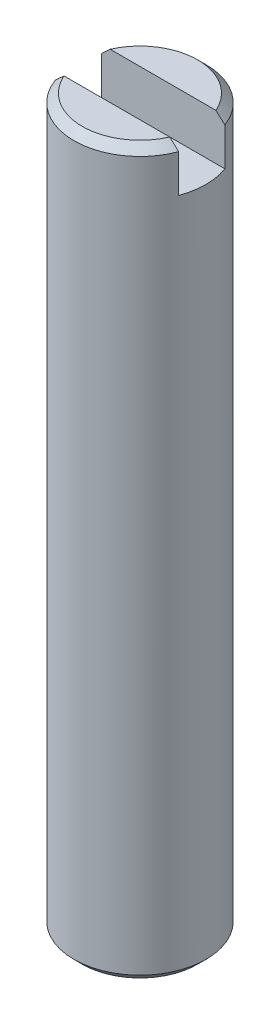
from build123d import *

# Parameters (mm, degrees)
ESQUISSE1_R             = 2
BASE_EXTRUSION_DEPTH    = 22
CHANFREIN1_SIZE         = 0.25
ENL_V_MAT_EXTRU_1_DEPTH = 1.4


with BuildPart() as part:
    # Esquisse1 → Base-Extrusion (new body)
    with BuildSketch(Plane(origin=(0, 0, 0), x_dir=(1, 0, 0), z_dir=(0, 1, 0))):
        with Locations(Location((0, 0, 0), (0, 0, 270))):
            Circle(ESQUISSE1_R)
    extrude(amount=-BASE_EXTRUSION_DEPTH)

    # Chanfrein1
    chanfrein1_edges = [part.edges().sort_by_distance(p)[0] for p in [
        (0, 0, -2),
        (0, -22, -2),
    ]]
    chamfer(chanfrein1_edges, length=CHANFREIN1_SIZE)

    # Esquisse2 → Enl_v. mat.-Extru.1 (cut)
    with BuildSketch(Plane(origin=(0, 0, 0), x_dir=(-1, 0, 0), z_dir=(0, 1, 0))):
        with BuildLine():
            Line((-1.8734994, -0.7), (1.8734994, -0.7))
            ThreePointArc((1.8734994, -0.7), (2, 0), (1.8734994, 0.7))
            Line((1.8734994, 0.7), (-1.8734994, 0.7))
            ThreePointArc((-1.8734994, 0.7), (-2, 0), (-1.8734994, -0.7))
        make_face()
    extrude(amount=-ENL_V_MAT_EXTRU_1_DEPTH, mode=Mode.SUBTRACT)


solid = part.part
